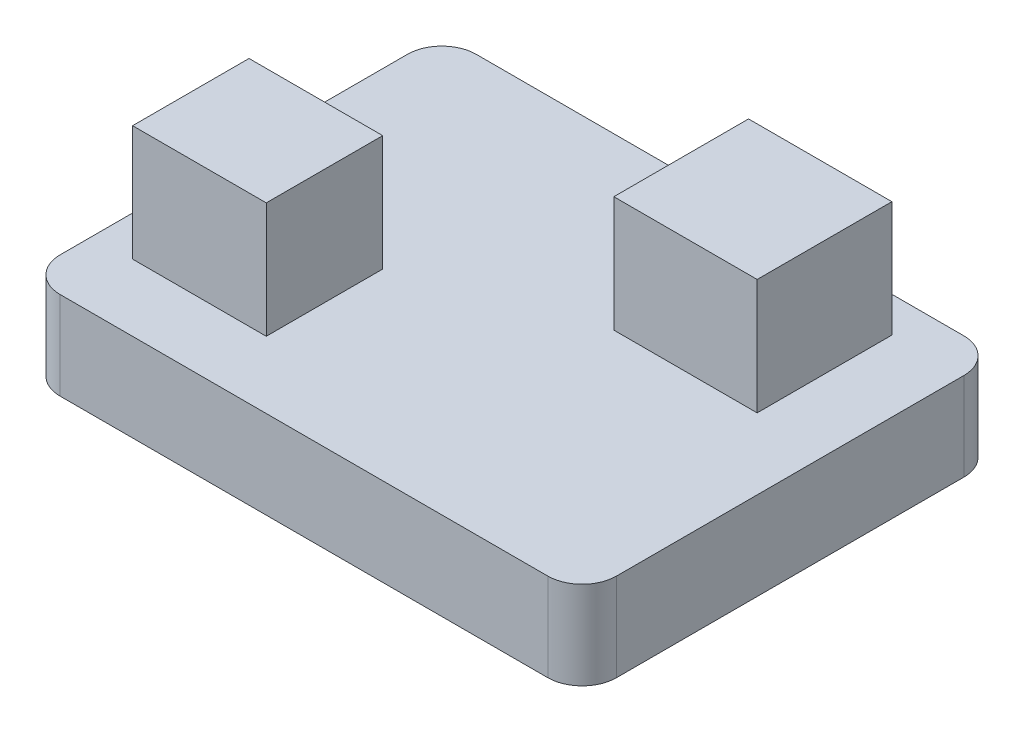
from build123d import *

# Parameters (mm, degrees)
SKETCH1_W      = 205.46774718
SKETCH1_H      = 153.65414137
EXTRUDE1_DEPTH = 32.512
SKETCH2_W      = 49.365678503
SKETCH2_H      = 43.003048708
SKETCH2_W_2    = 52.928396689
SKETCH2_H_2    = 49.754631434
EXTRUDE2_DEPTH = 42.672
FILLET1_R      = 12.7


with BuildPart() as part:
    # Sketch1 → Extrude1 (new body)
    with BuildSketch(Plane(origin=(0, 0, 0), x_dir=(1, 0, 0), z_dir=(0, 1, 0))):
        Rectangle(SKETCH1_W, SKETCH1_H)
    extrude(amount=EXTRUDE1_DEPTH)

    # Sketch2 → Extrude2 (add)
    with BuildSketch(Plane(origin=(0, 32.512, 0), x_dir=(1, 0, 0), z_dir=(0, 1, 0))):
        with Locations((-63.303156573, -30.627684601)):
            Rectangle(SKETCH2_W, SKETCH2_H)
        with Locations((50.048408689, 38.896919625)):
            Rectangle(SKETCH2_W_2, SKETCH2_H_2)
    extrude(amount=EXTRUDE2_DEPTH)

    # Fillet1
    fillet1_edges = [part.edges().sort_by_distance(p)[0] for p in [
        (102.73387359, 16.256, 76.827070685),
        (-102.73387359, 16.256, 76.827070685),
        (-102.73387359, 16.256, -76.827070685),
        (102.73387359, 16.256, -76.827070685),
    ]]
    fillet(fillet1_edges, radius=FILLET1_R)


solid = part.part
